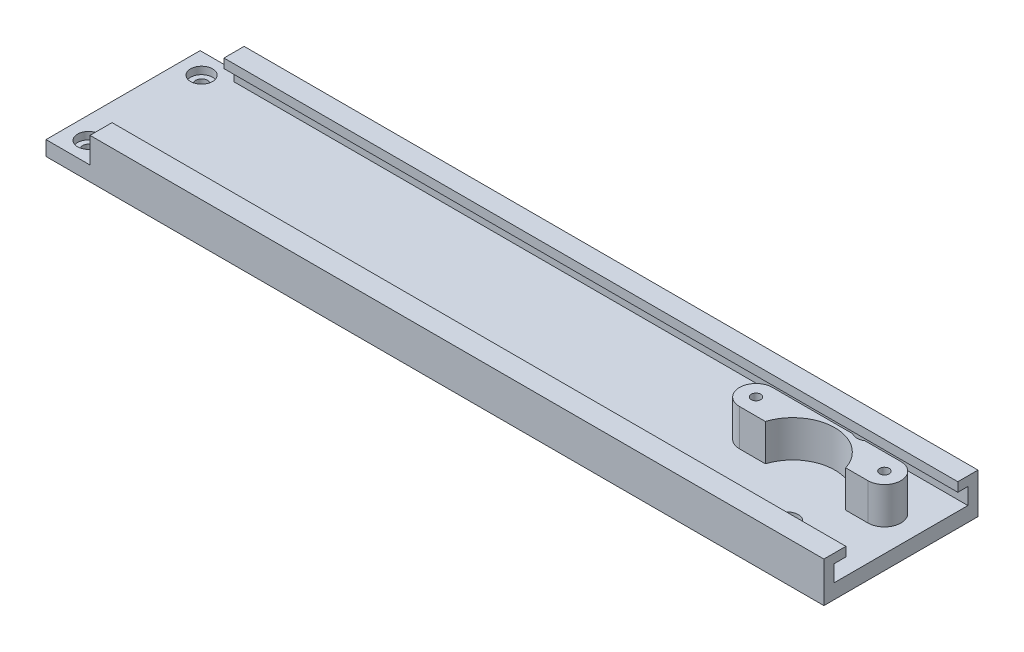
from build123d import *

# Parameters (mm, degrees)
SKETCH1_W           = 212
SKETCH1_H           = 42
BOSS_EXTRUDE1_DEPTH = 4
BOSS_EXTRUDE2_DEPTH = 200
SKETCH3_R           = 3
CUT_EXTRUDE1_DEPTH  = 2
SKETCH4_R           = 1.6
CUT_EXTRUDE2_DEPTH  = 109.434311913
SKETCH5_R           = 1.3
BOSS_EXTRUDE3_DEPTH = 10
SKETCH6_R           = 3
CUT_EXTRUDE3_DEPTH  = 2
SKETCH8_R           = 1.6
CUT_EXTRUDE4_DEPTH  = 109.724422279
SKETCH10_R          = 11.5
CUT_EXTRUDE5_DEPTH  = 10
CUT_EXTRUDE6_REACH  = 110.963
SKETCH11_R          = 3


with BuildPart() as part:
    # Sketch1 → Boss-Extrude1 (new body)
    with BuildSketch(Plane(origin=(0, 0, 0), x_dir=(1, 0, 0), z_dir=(0, 1, 0))):
        Rectangle(SKETCH1_W, SKETCH1_H)
    extrude(amount=BOSS_EXTRUDE1_DEPTH)

    # Sketch2 → Boss-Extrude2 (add)
    with BuildSketch(Plane(origin=(106, 0, 0), x_dir=(0, 0, -1), z_dir=(1, 0, 0))):
        Polygon((-21, 0), (-21, 11), (-15, 11), (-15, 8.5), (-18.25, 8.5), (-18.25, 0), align=None)
        Polygon((18.25, 8.5), (18.25, 0), (21, 0), (21, 11), (15.5, 11), (15.5, 8.5), align=None)
    extrude(amount=-BOSS_EXTRUDE2_DEPTH)

    # Sketch3 → Cut-Extrude1 (cut)
    with BuildSketch(Plane(origin=(0, 4, 0), x_dir=(1, 0, 0), z_dir=(0, 1, 0))):
        with Locations(Location((-100, -15.4, 0), (0, 0, 270))):
            Circle(SKETCH3_R)
    cut_extrude1 = extrude(amount=-CUT_EXTRUDE1_DEPTH, mode=Mode.SUBTRACT)

    # Sketch4 → Cut-Extrude2 (cut, through all)
    with BuildSketch(Plane(origin=(0, 2, 0), x_dir=(1, 0, 0), z_dir=(0, 1, 0))):
        with Locations(Location((-100, -15.4, 0), (0, 0, 270))):
            Circle(SKETCH4_R)
    cut_extrude2 = extrude(amount=-CUT_EXTRUDE2_DEPTH, mode=Mode.SUBTRACT)

    # Mirror1: Cut-Extrude1, Cut-Extrude2 across plane
    add(cut_extrude1.mirror(Plane.XY), mode=Mode.SUBTRACT)
    add(cut_extrude2.mirror(Plane.XY), mode=Mode.SUBTRACT)

    # Sketch5 → Boss-Extrude3 (add)
    with BuildSketch(Plane(origin=(0, 4, 0), x_dir=(1, 0, 0), z_dir=(0, 1, 0))):
        with BuildLine():
            Line((61.5, 9.5), (96.5, 9.5))
            ThreePointArc((96.5, 9.5), (101, 5), (96.5, 0.5))
            Line((96.5, 0.5), (61.5, 0.5))
            ThreePointArc((61.5, 0.5), (57, 5), (61.5, 9.5))
        make_face()
        with Locations(Location((96.5, 5, 0), (0, 0, 270))):
            Circle(SKETCH5_R, mode=Mode.SUBTRACT)
        with Locations(Location((61.5, 5, 0), (0, 0, 270))):
            Circle(SKETCH5_R, mode=Mode.SUBTRACT)
    extrude(amount=BOSS_EXTRUDE3_DEPTH)

    # Sketch6 → Cut-Extrude3 (cut)
    with BuildSketch(Plane(origin=(0, 4, 0), x_dir=(1, 0, 0), z_dir=(0, 1, 0))):
        with Locations(Location((85, -10, 0), (0, 0, 270))):
            Circle(SKETCH6_R)
        with Locations(Location((85, 12, 0), (0, 0, 270))):
            Circle(SKETCH6_R)
    extrude(amount=-CUT_EXTRUDE3_DEPTH, mode=Mode.SUBTRACT)

    # Sketch8 → Cut-Extrude4 (cut, through all)
    with BuildSketch(Plane(origin=(0, 2, 0), x_dir=(1, 0, 0), z_dir=(0, 1, 0))):
        with Locations(Location((85, 12, 0), (0, 0, 270))):
            Circle(SKETCH8_R)
        with Locations(Location((85, -10, 0), (0, 0, 270))):
            Circle(SKETCH8_R)
    extrude(amount=-CUT_EXTRUDE4_DEPTH, mode=Mode.SUBTRACT)

    # Sketch10 → Cut-Extrude5 (cut)
    with BuildSketch(Plane(origin=(0, 14, 0), x_dir=(1, 0, 0), z_dir=(0, 1, 0))):
        with Locations((79.5, -3)):
            Circle(SKETCH10_R)
    extrude(amount=-CUT_EXTRUDE5_DEPTH, mode=Mode.SUBTRACT)

    # Sketch11 → Cut-Extrude6 (cut, up to next)
    with BuildSketch(Plane(origin=(0, 14, 0), x_dir=(1, 0, 0), z_dir=(0, 1, 0)), mode=Mode.PRIVATE) as cut_extrude6_sk1:
        with Locations(Location((85, 12, 0), (0, 0, 270))):
            Circle(SKETCH11_R)
    cut_extrude6_tool1 = extrude(cut_extrude6_sk1.sketch, amount=-CUT_EXTRUDE6_REACH, mode=Mode.PRIVATE) & part.part
    add(cut_extrude6_tool1.solids().sort_by_distance((85, 14, -12))[0], mode=Mode.SUBTRACT)


solid = part.part
